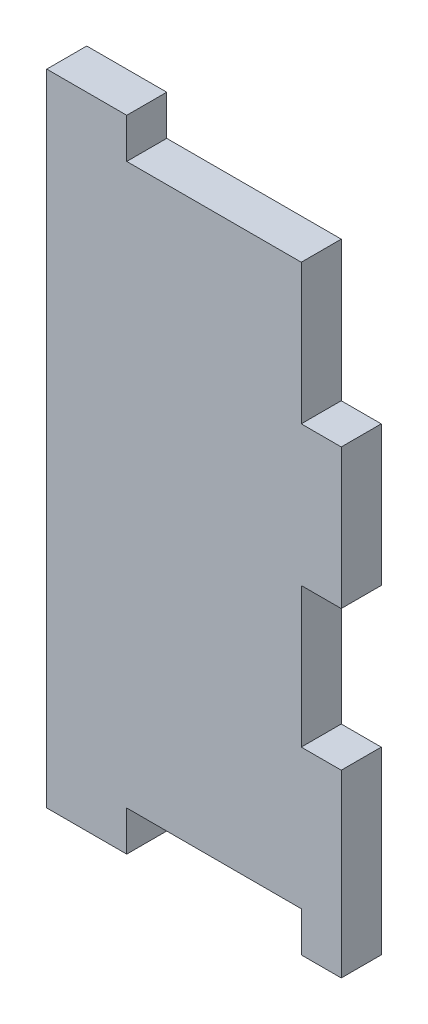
from build123d import *

# Parameters (mm, degrees)
BOSS_EXTRUDE1_DEPTH = 6.35
SKETCH2_W           = 6.35
SKETCH2_H           = 28.575
SKETCH2_H_2         = 22.225
CUT_EXTRUDE1_DEPTH  = 57.281610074


with BuildPart() as part:
    # Sketch1 → Boss-Extrude1 (new body)
    with BuildSketch(Plane.XY):
        Polygon((23.3807, 50.8), (17.0307, 50.8), (17.0307, 44.45), (-10.6807, 44.45), (-10.6807, 50.8), (-23.3807, 50.8), (-23.3807, -50.8), (-10.6807, -50.8), (-10.6807, -44.45), (17.0307, -44.45), (17.0307, -50.8), (23.3807, -50.8), align=None)
    extrude(amount=BOSS_EXTRUDE1_DEPTH)

    # Sketch2 → Cut-Extrude1 (cut, through all)
    with BuildSketch(Plane.XY.offset(6.35)):
        with Locations((20.2057, 36.5125)):
            Rectangle(SKETCH2_W, SKETCH2_H)
        with Locations((20.2057, -11.1125)):
            Rectangle(SKETCH2_W, SKETCH2_H_2)
    extrude(amount=-CUT_EXTRUDE1_DEPTH, mode=Mode.SUBTRACT)


solid = part.part
